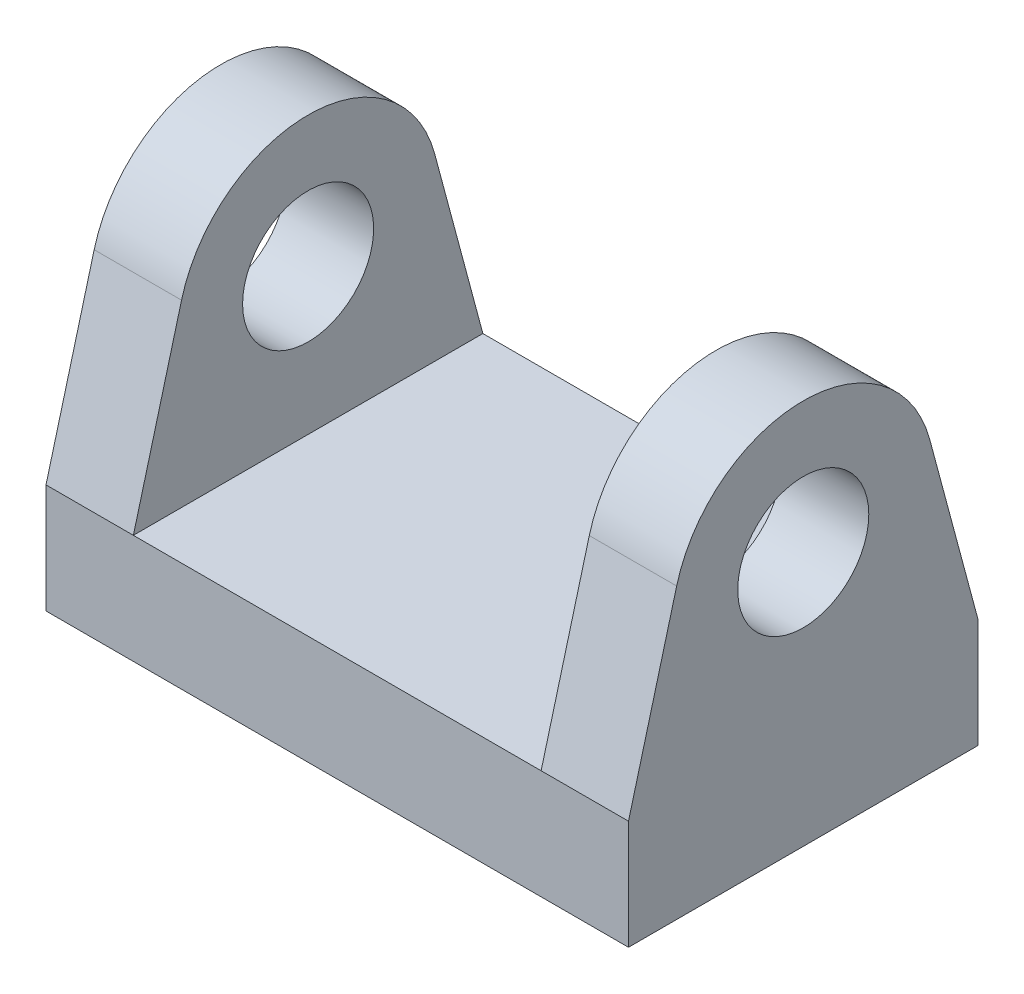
ISO-10303-21;
HEADER;
FILE_DESCRIPTION(('STEP AP214'),'2;1');
FILE_NAME('part.step','',(''),(''),'','','');
FILE_SCHEMA(('AUTOMOTIVE_DESIGN { 1 0 10303 214 1 1 1 1 }'));
ENDSEC;
DATA;
#1=APPLICATION_CONTEXT('core data for automotive mechanical design processes');
#2=APPLICATION_PROTOCOL_DEFINITION('international standard','automotive_design',2000,#1);
#3=PRODUCT_CONTEXT('',#1,'mechanical');
#4=PRODUCT('Part','Part','',(#3));
#5=PRODUCT_RELATED_PRODUCT_CATEGORY('part','',(#4));
#6=PRODUCT_DEFINITION_FORMATION('','',#4);
#7=PRODUCT_DEFINITION_CONTEXT('part definition',#1,'design');
#8=PRODUCT_DEFINITION('design','',#6,#7);
#9=PRODUCT_DEFINITION_SHAPE('','',#8);
#10=(LENGTH_UNIT() NAMED_UNIT(*) SI_UNIT(.MILLI.,.METRE.));
#11=(NAMED_UNIT(*) PLANE_ANGLE_UNIT() SI_UNIT($,.RADIAN.));
#12=(NAMED_UNIT(*) SI_UNIT($,.STERADIAN.) SOLID_ANGLE_UNIT());
#13=UNCERTAINTY_MEASURE_WITH_UNIT(LENGTH_MEASURE(1.E-05),#10,'distance_accuracy_value','');
#14=(GEOMETRIC_REPRESENTATION_CONTEXT(3) GLOBAL_UNCERTAINTY_ASSIGNED_CONTEXT((#13)) GLOBAL_UNIT_ASSIGNED_CONTEXT((#10,
#11,#12)) REPRESENTATION_CONTEXT('',''));
#15=CARTESIAN_POINT('',(0.,0.,0.));
#16=DIRECTION('',(0.,0.,1.));
#17=DIRECTION('',(1.,0.,0.));
#18=AXIS2_PLACEMENT_3D('',#15,#16,#17);
#19=CARTESIAN_POINT('',(-20.,17.5,0.));
#20=DIRECTION('',(1.,0.,0.));
#21=DIRECTION('',(0.,0.,-1.));
#22=AXIS2_PLACEMENT_3D('',#19,#20,#21);
#23=PLANE('',#22);
#24=CARTESIAN_POINT('',(-20.,17.5,0.));
#25=DIRECTION('',(-1.,0.,0.));
#26=DIRECTION('',(0.,0.,-1.));
#27=AXIS2_PLACEMENT_3D('',#24,#25,#26);
#28=CIRCLE('',#27,9.00000000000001);
#29=CARTESIAN_POINT('',(-20.,19.8313594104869,8.6927995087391));
#30=VERTEX_POINT('',#29);
#31=CARTESIAN_POINT('',(-20.,19.8313594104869,-8.69279950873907));
#32=VERTEX_POINT('',#31);
#33=EDGE_CURVE('E174',#30,#32,#28,.T.);
#34=ORIENTED_EDGE('',*,*,#33,.T.);
#35=DIRECTION('',(0.,-0.965866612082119,-0.259039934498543));
#36=VECTOR('',#35,1.);
#37=CARTESIAN_POINT('',(-20.,7.5,-12.));
#38=LINE('',#37,#36);
#39=CARTESIAN_POINT('',(-20.,7.5,-12.));
#40=VERTEX_POINT('',#39);
#41=EDGE_CURVE('E171',#32,#40,#38,.T.);
#42=ORIENTED_EDGE('',*,*,#41,.T.);
#43=DIRECTION('',(0.,-1.,0.));
#44=VECTOR('',#43,1.);
#45=CARTESIAN_POINT('',(-20.,0.,-12.));
#46=LINE('',#45,#44);
#47=CARTESIAN_POINT('',(-20.,0.,-12.));
#48=VERTEX_POINT('',#47);
#49=EDGE_CURVE('E168',#40,#48,#46,.T.);
#50=ORIENTED_EDGE('',*,*,#49,.T.);
#51=DIRECTION('',(0.,0.,1.));
#52=VECTOR('',#51,1.);
#53=CARTESIAN_POINT('',(-20.,0.,12.));
#54=LINE('',#53,#52);
#55=CARTESIAN_POINT('',(-20.,0.,12.));
#56=VERTEX_POINT('',#55);
#57=EDGE_CURVE('E166',#48,#56,#54,.T.);
#58=ORIENTED_EDGE('',*,*,#57,.T.);
#59=DIRECTION('',(0.,1.,0.));
#60=VECTOR('',#59,1.);
#61=CARTESIAN_POINT('',(-20.,7.5,12.));
#62=LINE('',#61,#60);
#63=CARTESIAN_POINT('',(-20.,7.5,12.));
#64=VERTEX_POINT('',#63);
#65=EDGE_CURVE('E161',#56,#64,#62,.T.);
#66=ORIENTED_EDGE('',*,*,#65,.T.);
#67=DIRECTION('',(0.,0.965866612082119,-0.259039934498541));
#68=VECTOR('',#67,1.);
#69=CARTESIAN_POINT('',(-20.,19.8313594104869,8.6927995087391));
#70=LINE('',#69,#68);
#71=EDGE_CURVE('E159',#64,#30,#70,.T.);
#72=ORIENTED_EDGE('',*,*,#71,.T.);
#73=EDGE_LOOP('',(#34,#42,#50,#58,#66,#72));
#74=FACE_BOUND('',#73,.T.);
#75=CARTESIAN_POINT('',(-20.,17.5,0.));
#76=DIRECTION('',(-1.,0.,0.));
#77=DIRECTION('',(0.,0.,1.));
#78=AXIS2_PLACEMENT_3D('',#75,#76,#77);
#79=CIRCLE('',#78,4.49999999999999);
#80=CARTESIAN_POINT('',(-20.,17.5,4.49999999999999));
#81=VERTEX_POINT('',#80);
#82=EDGE_CURVE('E214',#81,#81,#79,.T.);
#83=ORIENTED_EDGE('',*,*,#82,.F.);
#84=EDGE_LOOP('',(#83));
#85=FACE_BOUND('',#84,.T.);
#86=ADVANCED_FACE('F33',(#74,#85),#23,.F.);
#87=CARTESIAN_POINT('',(20.,17.5,0.));
#88=DIRECTION('',(-1.,0.,0.));
#89=DIRECTION('',(0.,0.,1.));
#90=AXIS2_PLACEMENT_3D('',#87,#88,#89);
#91=PLANE('',#90);
#92=CARTESIAN_POINT('',(20.,17.5,0.));
#93=DIRECTION('',(1.,0.,0.));
#94=DIRECTION('',(0.,0.,1.));
#95=AXIS2_PLACEMENT_3D('',#92,#93,#94);
#96=CIRCLE('',#95,9.00000000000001);
#97=CARTESIAN_POINT('',(20.,19.8313594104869,-8.69279950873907));
#98=VERTEX_POINT('',#97);
#99=CARTESIAN_POINT('',(20.,19.8313594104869,8.69279950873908));
#100=VERTEX_POINT('',#99);
#101=EDGE_CURVE('E136',#98,#100,#96,.T.);
#102=ORIENTED_EDGE('',*,*,#101,.T.);
#103=DIRECTION('',(0.,-0.965866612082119,0.259039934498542));
#104=VECTOR('',#103,1.);
#105=CARTESIAN_POINT('',(20.,7.5,12.));
#106=LINE('',#105,#104);
#107=CARTESIAN_POINT('',(20.,7.5,12.));
#108=VERTEX_POINT('',#107);
#109=EDGE_CURVE('E187',#100,#108,#106,.T.);
#110=ORIENTED_EDGE('',*,*,#109,.T.);
#111=DIRECTION('',(0.,-1.,0.));
#112=VECTOR('',#111,1.);
#113=CARTESIAN_POINT('',(20.,0.,12.));
#114=LINE('',#113,#112);
#115=CARTESIAN_POINT('',(20.,0.,12.));
#116=VERTEX_POINT('',#115);
#117=EDGE_CURVE('E184',#108,#116,#114,.T.);
#118=ORIENTED_EDGE('',*,*,#117,.T.);
#119=DIRECTION('',(0.,0.,-1.));
#120=VECTOR('',#119,1.);
#121=CARTESIAN_POINT('',(20.,0.,-12.));
#122=LINE('',#121,#120);
#123=CARTESIAN_POINT('',(20.,0.,-12.));
#124=VERTEX_POINT('',#123);
#125=EDGE_CURVE('E182',#116,#124,#122,.T.);
#126=ORIENTED_EDGE('',*,*,#125,.T.);
#127=DIRECTION('',(0.,1.,0.));
#128=VECTOR('',#127,1.);
#129=CARTESIAN_POINT('',(20.,7.5,-12.));
#130=LINE('',#129,#128);
#131=CARTESIAN_POINT('',(20.,7.5,-12.));
#132=VERTEX_POINT('',#131);
#133=EDGE_CURVE('E179',#124,#132,#130,.T.);
#134=ORIENTED_EDGE('',*,*,#133,.T.);
#135=DIRECTION('',(0.,0.965866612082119,0.259039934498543));
#136=VECTOR('',#135,1.);
#137=CARTESIAN_POINT('',(20.,19.8313594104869,-8.69279950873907));
#138=LINE('',#137,#136);
#139=EDGE_CURVE('E177',#132,#98,#138,.T.);
#140=ORIENTED_EDGE('',*,*,#139,.T.);
#141=EDGE_LOOP('',(#102,#110,#118,#126,#134,#140));
#142=FACE_BOUND('',#141,.T.);
#143=CARTESIAN_POINT('',(20.,17.5,0.));
#144=DIRECTION('',(1.,0.,0.));
#145=DIRECTION('',(0.,0.,-1.));
#146=AXIS2_PLACEMENT_3D('',#143,#144,#145);
#147=CIRCLE('',#146,4.49999999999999);
#148=CARTESIAN_POINT('',(20.,17.5,-4.49999999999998));
#149=VERTEX_POINT('',#148);
#150=EDGE_CURVE('E208',#149,#149,#147,.T.);
#151=ORIENTED_EDGE('',*,*,#150,.F.);
#152=EDGE_LOOP('',(#151));
#153=FACE_BOUND('',#152,.T.);
#154=ADVANCED_FACE('F222',(#142,#153),#91,.F.);
#155=CARTESIAN_POINT('',(-14.,17.5,0.));
#156=DIRECTION('',(1.,0.,0.));
#157=DIRECTION('',(0.,0.,-1.));
#158=AXIS2_PLACEMENT_3D('',#155,#156,#157);
#159=CYLINDRICAL_SURFACE('',#158,9.00000000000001);
#160=DIRECTION('',(1.,0.,0.));
#161=VECTOR('',#160,1.);
#162=CARTESIAN_POINT('',(-14.,19.8313594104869,-8.69279950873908));
#163=LINE('',#162,#161);
#164=CARTESIAN_POINT('',(14.,19.8313594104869,-8.69279950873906));
#165=VERTEX_POINT('',#164);
#166=EDGE_CURVE('E42',#165,#98,#163,.T.);
#167=ORIENTED_EDGE('',*,*,#166,.F.);
#168=CARTESIAN_POINT('',(14.,17.5,0.));
#169=DIRECTION('',(-1.,0.,0.));
#170=DIRECTION('',(0.,0.,1.));
#171=AXIS2_PLACEMENT_3D('',#168,#169,#170);
#172=CIRCLE('',#171,9.);
#173=CARTESIAN_POINT('',(14.,19.8313594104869,8.69279950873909));
#174=VERTEX_POINT('',#173);
#175=EDGE_CURVE('E113',#174,#165,#172,.T.);
#176=ORIENTED_EDGE('',*,*,#175,.F.);
#177=DIRECTION('',(1.,0.,0.));
#178=VECTOR('',#177,1.);
#179=CARTESIAN_POINT('',(-14.,19.8313594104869,8.69279950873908));
#180=LINE('',#179,#178);
#181=EDGE_CURVE('E150',#174,#100,#180,.T.);
#182=ORIENTED_EDGE('',*,*,#181,.T.);
#183=ORIENTED_EDGE('',*,*,#101,.F.);
#184=EDGE_LOOP('',(#167,#176,#182,#183));
#185=FACE_BOUND('',#184,.T.);
#186=ADVANCED_FACE('F134',(#185),#159,.T.);
#187=CARTESIAN_POINT('',(-14.,7.5,-12.));
#188=DIRECTION('',(0.,0.259039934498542,-0.965866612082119));
#189=DIRECTION('',(0.,0.965866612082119,0.259039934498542));
#190=AXIS2_PLACEMENT_3D('',#187,#188,#189);
#191=PLANE('',#190);
#192=DIRECTION('',(1.,0.,0.));
#193=VECTOR('',#192,1.);
#194=CARTESIAN_POINT('',(-14.,7.5,-12.));
#195=LINE('',#194,#193);
#196=CARTESIAN_POINT('',(14.,7.5,-12.));
#197=VERTEX_POINT('',#196);
#198=EDGE_CURVE('E129',#197,#132,#195,.T.);
#199=ORIENTED_EDGE('',*,*,#198,.F.);
#200=DIRECTION('',(0.,-0.965866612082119,-0.259039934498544));
#201=VECTOR('',#200,1.);
#202=CARTESIAN_POINT('',(14.,19.8313594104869,-8.69279950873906));
#203=LINE('',#202,#201);
#204=EDGE_CURVE('E117',#165,#197,#203,.T.);
#205=ORIENTED_EDGE('',*,*,#204,.F.);
#206=ORIENTED_EDGE('',*,*,#166,.T.);
#207=ORIENTED_EDGE('',*,*,#139,.F.);
#208=EDGE_LOOP('',(#199,#205,#206,#207));
#209=FACE_BOUND('',#208,.T.);
#210=ADVANCED_FACE('F126',(#209),#191,.T.);
#211=CARTESIAN_POINT('',(-14.,19.8313594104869,8.69279950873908));
#212=DIRECTION('',(0.,0.259039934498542,0.965866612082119));
#213=DIRECTION('',(0.,-0.965866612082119,0.259039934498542));
#214=AXIS2_PLACEMENT_3D('',#211,#212,#213);
#215=PLANE('',#214);
#216=ORIENTED_EDGE('',*,*,#181,.F.);
#217=DIRECTION('',(0.,0.965866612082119,-0.259039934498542));
#218=VECTOR('',#217,1.);
#219=CARTESIAN_POINT('',(14.,7.5,12.));
#220=LINE('',#219,#218);
#221=CARTESIAN_POINT('',(14.,7.5,12.));
#222=VERTEX_POINT('',#221);
#223=EDGE_CURVE('E120',#222,#174,#220,.T.);
#224=ORIENTED_EDGE('',*,*,#223,.F.);
#225=DIRECTION('',(1.,0.,0.));
#226=VECTOR('',#225,1.);
#227=CARTESIAN_POINT('',(-14.,7.5,12.));
#228=LINE('',#227,#226);
#229=EDGE_CURVE('E145',#222,#108,#228,.T.);
#230=ORIENTED_EDGE('',*,*,#229,.T.);
#231=ORIENTED_EDGE('',*,*,#109,.F.);
#232=EDGE_LOOP('',(#216,#224,#230,#231));
#233=FACE_BOUND('',#232,.T.);
#234=ADVANCED_FACE('F249',(#233),#215,.T.);
#235=CARTESIAN_POINT('',(-14.,17.5,0.));
#236=DIRECTION('',(-1.,0.,0.));
#237=DIRECTION('',(0.,0.,1.));
#238=AXIS2_PLACEMENT_3D('',#235,#236,#237);
#239=CIRCLE('',#238,9.);
#240=CARTESIAN_POINT('',(-14.,19.8313594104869,8.69279950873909));
#241=VERTEX_POINT('',#240);
#242=CARTESIAN_POINT('',(-14.,19.8313594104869,-8.69279950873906));
#243=VERTEX_POINT('',#242);
#244=EDGE_CURVE('E201',#241,#243,#239,.T.);
#245=ORIENTED_EDGE('',*,*,#244,.T.);
#246=EDGE_CURVE('E11',#32,#243,#163,.T.);
#247=ORIENTED_EDGE('',*,*,#246,.F.);
#248=ORIENTED_EDGE('',*,*,#33,.F.);
#249=EDGE_CURVE('E37',#30,#241,#180,.T.);
#250=ORIENTED_EDGE('',*,*,#249,.T.);
#251=EDGE_LOOP('',(#245,#247,#248,#250));
#252=FACE_BOUND('',#251,.T.);
#253=ADVANCED_FACE('F35',(#252),#159,.T.);
#254=DIRECTION('',(0.,-0.965866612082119,-0.259039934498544));
#255=VECTOR('',#254,1.);
#256=CARTESIAN_POINT('',(-14.,19.8313594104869,-8.69279950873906));
#257=LINE('',#256,#255);
#258=CARTESIAN_POINT('',(-14.,7.5,-12.));
#259=VERTEX_POINT('',#258);
#260=EDGE_CURVE('E198',#243,#259,#257,.T.);
#261=ORIENTED_EDGE('',*,*,#260,.T.);
#262=EDGE_CURVE('E137',#40,#259,#195,.T.);
#263=ORIENTED_EDGE('',*,*,#262,.F.);
#264=ORIENTED_EDGE('',*,*,#41,.F.);
#265=ORIENTED_EDGE('',*,*,#246,.T.);
#266=EDGE_LOOP('',(#261,#263,#264,#265));
#267=FACE_BOUND('',#266,.T.);
#268=ADVANCED_FACE('F245',(#267),#191,.T.);
#269=DIRECTION('',(0.,0.965866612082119,-0.259039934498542));
#270=VECTOR('',#269,1.);
#271=CARTESIAN_POINT('',(-14.,7.5,12.));
#272=LINE('',#271,#270);
#273=CARTESIAN_POINT('',(-14.,7.5,12.));
#274=VERTEX_POINT('',#273);
#275=EDGE_CURVE('E50',#274,#241,#272,.T.);
#276=ORIENTED_EDGE('',*,*,#275,.T.);
#277=ORIENTED_EDGE('',*,*,#249,.F.);
#278=ORIENTED_EDGE('',*,*,#71,.F.);
#279=EDGE_CURVE('E143',#64,#274,#228,.T.);
#280=ORIENTED_EDGE('',*,*,#279,.T.);
#281=EDGE_LOOP('',(#276,#277,#278,#280));
#282=FACE_BOUND('',#281,.T.);
#283=ADVANCED_FACE('F243',(#282),#215,.T.);
#284=CARTESIAN_POINT('',(14.,0.,-12.));
#285=DIRECTION('',(0.,0.,1.));
#286=DIRECTION('',(1.,0.,0.));
#287=AXIS2_PLACEMENT_3D('',#284,#285,#286);
#288=PLANE('',#287);
#289=ORIENTED_EDGE('',*,*,#262,.T.);
#290=DIRECTION('',(-1.,0.,0.));
#291=VECTOR('',#290,1.);
#292=CARTESIAN_POINT('',(14.,7.5,-12.));
#293=LINE('',#292,#291);
#294=EDGE_CURVE('E191',#197,#259,#293,.T.);
#295=ORIENTED_EDGE('',*,*,#294,.F.);
#296=ORIENTED_EDGE('',*,*,#198,.T.);
#297=ORIENTED_EDGE('',*,*,#133,.F.);
#298=DIRECTION('',(1.,0.,0.));
#299=VECTOR('',#298,1.);
#300=CARTESIAN_POINT('',(14.,0.,-12.));
#301=LINE('',#300,#299);
#302=EDGE_CURVE('E154',#48,#124,#301,.T.);
#303=ORIENTED_EDGE('',*,*,#302,.F.);
#304=ORIENTED_EDGE('',*,*,#49,.F.);
#305=EDGE_LOOP('',(#289,#295,#296,#297,#303,#304));
#306=FACE_BOUND('',#305,.T.);
#307=ADVANCED_FACE('F239',(#306),#288,.F.);
#308=CARTESIAN_POINT('',(-14.,0.,12.));
#309=DIRECTION('',(0.,0.,-1.));
#310=DIRECTION('',(-1.,0.,0.));
#311=AXIS2_PLACEMENT_3D('',#308,#309,#310);
#312=PLANE('',#311);
#313=ORIENTED_EDGE('',*,*,#279,.F.);
#314=ORIENTED_EDGE('',*,*,#65,.F.);
#315=DIRECTION('',(-1.,0.,0.));
#316=VECTOR('',#315,1.);
#317=CARTESIAN_POINT('',(-14.,0.,12.));
#318=LINE('',#317,#316);
#319=EDGE_CURVE('E141',#116,#56,#318,.T.);
#320=ORIENTED_EDGE('',*,*,#319,.F.);
#321=ORIENTED_EDGE('',*,*,#117,.F.);
#322=ORIENTED_EDGE('',*,*,#229,.F.);
#323=DIRECTION('',(-1.,0.,0.));
#324=VECTOR('',#323,1.);
#325=CARTESIAN_POINT('',(14.,7.5,12.));
#326=LINE('',#325,#324);
#327=EDGE_CURVE('E190',#222,#274,#326,.T.);
#328=ORIENTED_EDGE('',*,*,#327,.T.);
#329=EDGE_LOOP('',(#313,#314,#320,#321,#322,#328));
#330=FACE_BOUND('',#329,.T.);
#331=ADVANCED_FACE('F236',(#330),#312,.F.);
#332=CARTESIAN_POINT('',(0.,0.,0.));
#333=DIRECTION('',(0.,1.,0.));
#334=DIRECTION('',(0.,0.,1.));
#335=AXIS2_PLACEMENT_3D('',#332,#333,#334);
#336=PLANE('',#335);
#337=ORIENTED_EDGE('',*,*,#319,.T.);
#338=ORIENTED_EDGE('',*,*,#57,.F.);
#339=ORIENTED_EDGE('',*,*,#302,.T.);
#340=ORIENTED_EDGE('',*,*,#125,.F.);
#341=EDGE_LOOP('',(#337,#338,#339,#340));
#342=FACE_BOUND('',#341,.T.);
#343=ADVANCED_FACE('F232',(#342),#336,.F.);
#344=CARTESIAN_POINT('',(14.,7.5,-12.));
#345=DIRECTION('',(0.,-1.,0.));
#346=DIRECTION('',(0.,0.,-1.));
#347=AXIS2_PLACEMENT_3D('',#344,#345,#346);
#348=PLANE('',#347);
#349=DIRECTION('',(0.,0.,1.));
#350=VECTOR('',#349,1.);
#351=CARTESIAN_POINT('',(-14.,7.5,-12.));
#352=LINE('',#351,#350);
#353=EDGE_CURVE('E196',#259,#274,#352,.T.);
#354=ORIENTED_EDGE('',*,*,#353,.T.);
#355=ORIENTED_EDGE('',*,*,#327,.F.);
#356=DIRECTION('',(0.,0.,1.));
#357=VECTOR('',#356,1.);
#358=CARTESIAN_POINT('',(14.,7.5,-12.));
#359=LINE('',#358,#357);
#360=EDGE_CURVE('E131',#197,#222,#359,.T.);
#361=ORIENTED_EDGE('',*,*,#360,.F.);
#362=ORIENTED_EDGE('',*,*,#294,.T.);
#363=EDGE_LOOP('',(#354,#355,#361,#362));
#364=FACE_BOUND('',#363,.T.);
#365=ADVANCED_FACE('F235',(#364),#348,.F.);
#366=CARTESIAN_POINT('',(14.,17.5,0.));
#367=DIRECTION('',(-1.,0.,0.));
#368=DIRECTION('',(0.,0.,1.));
#369=AXIS2_PLACEMENT_3D('',#366,#367,#368);
#370=PLANE('',#369);
#371=CARTESIAN_POINT('',(14.,17.5,0.));
#372=DIRECTION('',(-1.,0.,0.));
#373=DIRECTION('',(0.,0.,1.));
#374=AXIS2_PLACEMENT_3D('',#371,#372,#373);
#375=CIRCLE('',#374,4.49999999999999);
#376=CARTESIAN_POINT('',(14.,17.5,4.49999999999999));
#377=VERTEX_POINT('',#376);
#378=EDGE_CURVE('E203',#377,#377,#375,.T.);
#379=ORIENTED_EDGE('',*,*,#378,.F.);
#380=EDGE_LOOP('',(#379));
#381=FACE_BOUND('',#380,.T.);
#382=ORIENTED_EDGE('',*,*,#175,.T.);
#383=ORIENTED_EDGE('',*,*,#204,.T.);
#384=ORIENTED_EDGE('',*,*,#360,.T.);
#385=ORIENTED_EDGE('',*,*,#223,.T.);
#386=EDGE_LOOP('',(#382,#383,#384,#385));
#387=FACE_BOUND('',#386,.T.);
#388=ADVANCED_FACE('F115',(#381,#387),#370,.T.);
#389=CARTESIAN_POINT('',(-14.,17.5,0.));
#390=DIRECTION('',(-1.,0.,0.));
#391=DIRECTION('',(0.,0.,1.));
#392=AXIS2_PLACEMENT_3D('',#389,#390,#391);
#393=PLANE('',#392);
#394=CARTESIAN_POINT('',(-14.,17.5,0.));
#395=DIRECTION('',(-1.,0.,0.));
#396=DIRECTION('',(0.,0.,1.));
#397=AXIS2_PLACEMENT_3D('',#394,#395,#396);
#398=CIRCLE('',#397,4.49999999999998);
#399=CARTESIAN_POINT('',(-14.,17.5,4.49999999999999));
#400=VERTEX_POINT('',#399);
#401=EDGE_CURVE('E211',#400,#400,#398,.T.);
#402=ORIENTED_EDGE('',*,*,#401,.T.);
#403=EDGE_LOOP('',(#402));
#404=FACE_BOUND('',#403,.T.);
#405=ORIENTED_EDGE('',*,*,#244,.F.);
#406=ORIENTED_EDGE('',*,*,#275,.F.);
#407=ORIENTED_EDGE('',*,*,#353,.F.);
#408=ORIENTED_EDGE('',*,*,#260,.F.);
#409=EDGE_LOOP('',(#405,#406,#407,#408));
#410=FACE_BOUND('',#409,.T.);
#411=ADVANCED_FACE('F262',(#404,#410),#393,.F.);
#412=CARTESIAN_POINT('',(20.,17.5,0.));
#413=DIRECTION('',(1.,0.,0.));
#414=DIRECTION('',(0.,0.,-1.));
#415=AXIS2_PLACEMENT_3D('',#412,#413,#414);
#416=CYLINDRICAL_SURFACE('',#415,4.49999999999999);
#417=ORIENTED_EDGE('',*,*,#150,.T.);
#418=EDGE_LOOP('',(#417));
#419=FACE_BOUND('',#418,.T.);
#420=ORIENTED_EDGE('',*,*,#378,.T.);
#421=EDGE_LOOP('',(#420));
#422=FACE_BOUND('',#421,.T.);
#423=ADVANCED_FACE('F266',(#419,#422),#416,.F.);
#424=CARTESIAN_POINT('',(-20.,17.5,0.));
#425=DIRECTION('',(-1.,0.,0.));
#426=DIRECTION('',(0.,0.,1.));
#427=AXIS2_PLACEMENT_3D('',#424,#425,#426);
#428=CYLINDRICAL_SURFACE('',#427,4.49999999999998);
#429=ORIENTED_EDGE('',*,*,#82,.T.);
#430=EDGE_LOOP('',(#429));
#431=FACE_BOUND('',#430,.T.);
#432=ORIENTED_EDGE('',*,*,#401,.F.);
#433=EDGE_LOOP('',(#432));
#434=FACE_BOUND('',#433,.T.);
#435=ADVANCED_FACE('F218',(#431,#434),#428,.F.);
#436=CLOSED_SHELL('',(#86,#154,#186,#210,#234,#253,#268,#283,#307,#331,#343,#365,#388,#411,#423,#435));
#437=MANIFOLD_SOLID_BREP('B2',#436);
#438=ADVANCED_BREP_SHAPE_REPRESENTATION('',(#18,#437),#14);
#439=SHAPE_DEFINITION_REPRESENTATION(#9,#438);
ENDSEC;
END-ISO-10303-21;
